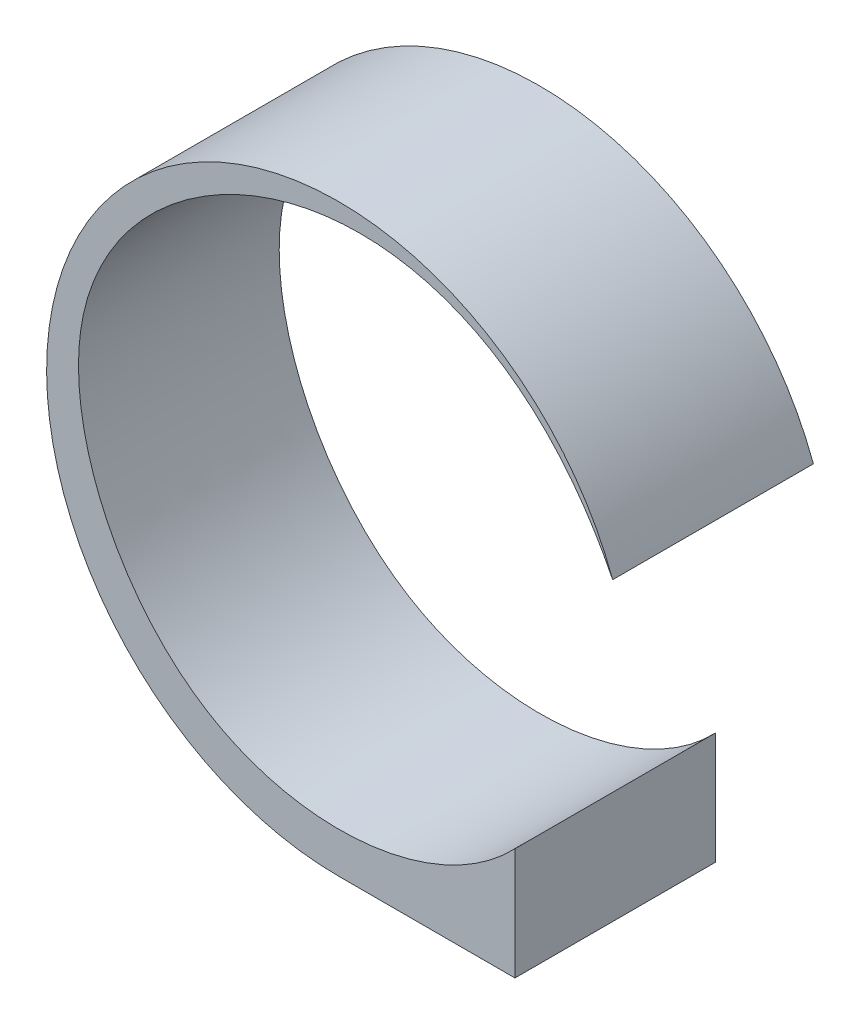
ISO-10303-21;
HEADER;
FILE_DESCRIPTION(('STEP AP214'),'2;1');
FILE_NAME('part.step','',(''),(''),'','','');
FILE_SCHEMA(('AUTOMOTIVE_DESIGN { 1 0 10303 214 1 1 1 1 }'));
ENDSEC;
DATA;
#1=APPLICATION_CONTEXT('core data for automotive mechanical design processes');
#2=APPLICATION_PROTOCOL_DEFINITION('international standard','automotive_design',2000,#1);
#3=PRODUCT_CONTEXT('',#1,'mechanical');
#4=PRODUCT('Part','Part','',(#3));
#5=PRODUCT_RELATED_PRODUCT_CATEGORY('part','',(#4));
#6=PRODUCT_DEFINITION_FORMATION('','',#4);
#7=PRODUCT_DEFINITION_CONTEXT('part definition',#1,'design');
#8=PRODUCT_DEFINITION('design','',#6,#7);
#9=PRODUCT_DEFINITION_SHAPE('','',#8);
#10=(LENGTH_UNIT() NAMED_UNIT(*) SI_UNIT(.MILLI.,.METRE.));
#11=(NAMED_UNIT(*) PLANE_ANGLE_UNIT() SI_UNIT($,.RADIAN.));
#12=(NAMED_UNIT(*) SI_UNIT($,.STERADIAN.) SOLID_ANGLE_UNIT());
#13=UNCERTAINTY_MEASURE_WITH_UNIT(LENGTH_MEASURE(1.E-05),#10,'distance_accuracy_value','');
#14=(GEOMETRIC_REPRESENTATION_CONTEXT(3) GLOBAL_UNCERTAINTY_ASSIGNED_CONTEXT((#13)) GLOBAL_UNIT_ASSIGNED_CONTEXT((#10,
#11,#12)) REPRESENTATION_CONTEXT('',''));
#15=CARTESIAN_POINT('',(0.,0.,0.));
#16=DIRECTION('',(0.,0.,1.));
#17=DIRECTION('',(1.,0.,0.));
#18=AXIS2_PLACEMENT_3D('',#15,#16,#17);
#19=CARTESIAN_POINT('',(31.75,30.1625,57.7576235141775));
#20=DIRECTION('',(0.,0.,-1.));
#21=DIRECTION('',(-1.,0.,0.));
#22=AXIS2_PLACEMENT_3D('',#19,#20,#21);
#23=CYLINDRICAL_SURFACE('',#22,16.637);
#24=CARTESIAN_POINT('',(31.75,30.1625,11.43));
#25=DIRECTION('',(0.,0.,1.));
#26=DIRECTION('',(1.,0.,0.));
#27=AXIS2_PLACEMENT_3D('',#24,#25,#26);
#28=CIRCLE('',#27,16.637);
#29=CARTESIAN_POINT('',(47.3479131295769,35.9499757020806,11.43));
#30=VERTEX_POINT('',#29);
#31=CARTESIAN_POINT('',(31.75,13.5255,11.43));
#32=VERTEX_POINT('',#31);
#33=EDGE_CURVE('E92',#30,#32,#28,.T.);
#34=ORIENTED_EDGE('',*,*,#33,.F.);
#35=DIRECTION('',(0.,0.,-1.));
#36=VECTOR('',#35,1.);
#37=CARTESIAN_POINT('',(47.3479131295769,35.9499757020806,57.7576235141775));
#38=LINE('',#37,#36);
#39=CARTESIAN_POINT('',(47.3479131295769,35.9499757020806,0.));
#40=VERTEX_POINT('',#39);
#41=EDGE_CURVE('E58',#30,#40,#38,.T.);
#42=ORIENTED_EDGE('',*,*,#41,.T.);
#43=CARTESIAN_POINT('',(31.75,30.1625,0.));
#44=DIRECTION('',(0.,0.,1.));
#45=DIRECTION('',(1.,0.,0.));
#46=AXIS2_PLACEMENT_3D('',#43,#44,#45);
#47=CIRCLE('',#46,16.637);
#48=CARTESIAN_POINT('',(31.75,13.5255,0.));
#49=VERTEX_POINT('',#48);
#50=EDGE_CURVE('E90',#40,#49,#47,.T.);
#51=ORIENTED_EDGE('',*,*,#50,.T.);
#52=DIRECTION('',(0.,0.,-1.));
#53=VECTOR('',#52,1.);
#54=CARTESIAN_POINT('',(31.75,13.5255,57.7576235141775));
#55=LINE('',#54,#53);
#56=EDGE_CURVE('E81',#32,#49,#55,.T.);
#57=ORIENTED_EDGE('',*,*,#56,.F.);
#58=EDGE_LOOP('',(#34,#42,#51,#57));
#59=FACE_BOUND('',#58,.T.);
#60=ADVANCED_FACE('F39',(#59),#23,.T.);
#61=CARTESIAN_POINT('',(31.75,13.5255,57.7576235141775));
#62=DIRECTION('',(0.,1.,0.));
#63=DIRECTION('',(0.,0.,1.));
#64=AXIS2_PLACEMENT_3D('',#61,#62,#63);
#65=PLANE('',#64);
#66=DIRECTION('',(1.,0.,0.));
#67=VECTOR('',#66,1.);
#68=CARTESIAN_POINT('',(31.75,13.5255,11.43));
#69=LINE('',#68,#67);
#70=CARTESIAN_POINT('',(41.783,13.5255,11.43));
#71=VERTEX_POINT('',#70);
#72=EDGE_CURVE('E50',#32,#71,#69,.T.);
#73=ORIENTED_EDGE('',*,*,#72,.F.);
#74=ORIENTED_EDGE('',*,*,#56,.T.);
#75=DIRECTION('',(1.,0.,0.));
#76=VECTOR('',#75,1.);
#77=CARTESIAN_POINT('',(31.75,13.5255,0.));
#78=LINE('',#77,#76);
#79=CARTESIAN_POINT('',(41.783,13.5255,0.));
#80=VERTEX_POINT('',#79);
#81=EDGE_CURVE('E102',#49,#80,#78,.T.);
#82=ORIENTED_EDGE('',*,*,#81,.T.);
#83=DIRECTION('',(0.,0.,-1.));
#84=VECTOR('',#83,1.);
#85=CARTESIAN_POINT('',(41.783,13.5255,57.7576235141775));
#86=LINE('',#85,#84);
#87=EDGE_CURVE('E116',#71,#80,#86,.T.);
#88=ORIENTED_EDGE('',*,*,#87,.F.);
#89=EDGE_LOOP('',(#73,#74,#82,#88));
#90=FACE_BOUND('',#89,.T.);
#91=ADVANCED_FACE('F126',(#90),#65,.F.);
#92=CARTESIAN_POINT('',(41.783,19.9014029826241,57.7576235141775));
#93=DIRECTION('',(-1.,0.,0.));
#94=DIRECTION('',(0.,0.,1.));
#95=AXIS2_PLACEMENT_3D('',#92,#93,#94);
#96=PLANE('',#95);
#97=DIRECTION('',(0.,1.,0.));
#98=VECTOR('',#97,1.);
#99=CARTESIAN_POINT('',(41.783,19.9014029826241,11.43));
#100=LINE('',#99,#98);
#101=CARTESIAN_POINT('',(41.783,19.9014029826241,11.43));
#102=VERTEX_POINT('',#101);
#103=EDGE_CURVE('E11',#71,#102,#100,.T.);
#104=ORIENTED_EDGE('',*,*,#103,.F.);
#105=ORIENTED_EDGE('',*,*,#87,.T.);
#106=DIRECTION('',(0.,1.,0.));
#107=VECTOR('',#106,1.);
#108=CARTESIAN_POINT('',(41.783,19.9014029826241,0.));
#109=LINE('',#108,#107);
#110=CARTESIAN_POINT('',(41.783,19.9014029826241,0.));
#111=VERTEX_POINT('',#110);
#112=EDGE_CURVE('E118',#80,#111,#109,.T.);
#113=ORIENTED_EDGE('',*,*,#112,.T.);
#114=DIRECTION('',(0.,0.,-1.));
#115=VECTOR('',#114,1.);
#116=CARTESIAN_POINT('',(41.783,19.9014029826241,57.7576235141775));
#117=LINE('',#116,#115);
#118=EDGE_CURVE('E64',#102,#111,#117,.T.);
#119=ORIENTED_EDGE('',*,*,#118,.F.);
#120=EDGE_LOOP('',(#104,#105,#113,#119));
#121=FACE_BOUND('',#120,.T.);
#122=ADVANCED_FACE('F125',(#121),#96,.F.);
#123=CARTESIAN_POINT('',(41.783,19.9014029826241,57.7576235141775));
#124=CARTESIAN_POINT('',(37.3883776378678,15.3004614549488,57.7576235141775));
#125=CARTESIAN_POINT('',(22.5097432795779,13.8278949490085,57.7576235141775));
#126=CARTESIAN_POINT('',(9.76714449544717,41.8095587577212,57.7576235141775));
#127=CARTESIAN_POINT('',(38.9103773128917,52.8968606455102,57.7576235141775));
#128=CARTESIAN_POINT('',(47.3479131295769,35.9499757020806,57.7576235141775));
#129=B_SPLINE_CURVE_WITH_KNOTS('',3,(#123,#124,#125,#126,#127,#128),.UNSPECIFIED.,.F.,.F.,(4,1,
1,4),(0.,0.262420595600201,0.499517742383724,1.),.UNSPECIFIED.);
#130=DIRECTION('',(0.,0.,-1.));
#131=VECTOR('',#130,1.);
#132=SURFACE_OF_LINEAR_EXTRUSION('',#129,#131);
#133=CARTESIAN_POINT('',(41.783,19.9014029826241,11.43));
#134=CARTESIAN_POINT('',(37.3883776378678,15.3004614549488,11.43));
#135=CARTESIAN_POINT('',(22.5097432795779,13.8278949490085,11.43));
#136=CARTESIAN_POINT('',(9.76714449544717,41.8095587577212,11.43));
#137=CARTESIAN_POINT('',(38.9103773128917,52.8968606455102,11.43));
#138=CARTESIAN_POINT('',(47.3479131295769,35.9499757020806,11.43));
#139=B_SPLINE_CURVE_WITH_KNOTS('',3,(#133,#134,#135,#136,#137,#138),.UNSPECIFIED.,.F.,.F.,(4,1,
1,4),(0.,0.262420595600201,0.499517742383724,1.),.UNSPECIFIED.);
#140=EDGE_CURVE('E99',#102,#30,#139,.T.);
#141=ORIENTED_EDGE('',*,*,#140,.F.);
#142=ORIENTED_EDGE('',*,*,#118,.T.);
#143=CARTESIAN_POINT('',(41.783,19.9014029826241,0.));
#144=CARTESIAN_POINT('',(37.3883776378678,15.3004614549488,0.));
#145=CARTESIAN_POINT('',(22.5097432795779,13.8278949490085,0.));
#146=CARTESIAN_POINT('',(9.76714449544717,41.8095587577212,0.));
#147=CARTESIAN_POINT('',(38.9103773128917,52.8968606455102,0.));
#148=CARTESIAN_POINT('',(47.3479131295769,35.9499757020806,0.));
#149=B_SPLINE_CURVE_WITH_KNOTS('',3,(#143,#144,#145,#146,#147,#148),.UNSPECIFIED.,.F.,.F.,(4,1,
1,4),(0.,0.262420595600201,0.499517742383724,1.),.UNSPECIFIED.);
#150=EDGE_CURVE('E95',#111,#40,#149,.T.);
#151=ORIENTED_EDGE('',*,*,#150,.T.);
#152=ORIENTED_EDGE('',*,*,#41,.F.);
#153=EDGE_LOOP('',(#141,#142,#151,#152));
#154=FACE_BOUND('',#153,.T.);
#155=ADVANCED_FACE('F96',(#154),#132,.F.);
#156=CARTESIAN_POINT('',(31.75,30.1625,0.));
#157=DIRECTION('',(0.,0.,1.));
#158=DIRECTION('',(1.,0.,0.));
#159=AXIS2_PLACEMENT_3D('',#156,#157,#158);
#160=PLANE('',#159);
#161=ORIENTED_EDGE('',*,*,#50,.F.);
#162=ORIENTED_EDGE('',*,*,#150,.F.);
#163=ORIENTED_EDGE('',*,*,#112,.F.);
#164=ORIENTED_EDGE('',*,*,#81,.F.);
#165=EDGE_LOOP('',(#161,#162,#163,#164));
#166=FACE_BOUND('',#165,.T.);
#167=ADVANCED_FACE('F101',(#166),#160,.F.);
#168=CARTESIAN_POINT('',(31.75,30.1625,11.43));
#169=DIRECTION('',(0.,0.,1.));
#170=DIRECTION('',(1.,0.,0.));
#171=AXIS2_PLACEMENT_3D('',#168,#169,#170);
#172=PLANE('',#171);
#173=ORIENTED_EDGE('',*,*,#140,.T.);
#174=ORIENTED_EDGE('',*,*,#33,.T.);
#175=ORIENTED_EDGE('',*,*,#72,.T.);
#176=ORIENTED_EDGE('',*,*,#103,.T.);
#177=EDGE_LOOP('',(#173,#174,#175,#176));
#178=FACE_BOUND('',#177,.T.);
#179=ADVANCED_FACE('F41',(#178),#172,.T.);
#180=CLOSED_SHELL('',(#60,#91,#122,#155,#167,#179));
#181=MANIFOLD_SOLID_BREP('B2',#180);
#182=ADVANCED_BREP_SHAPE_REPRESENTATION('',(#18,#181),#14);
#183=SHAPE_DEFINITION_REPRESENTATION(#9,#182);
ENDSEC;
END-ISO-10303-21;
